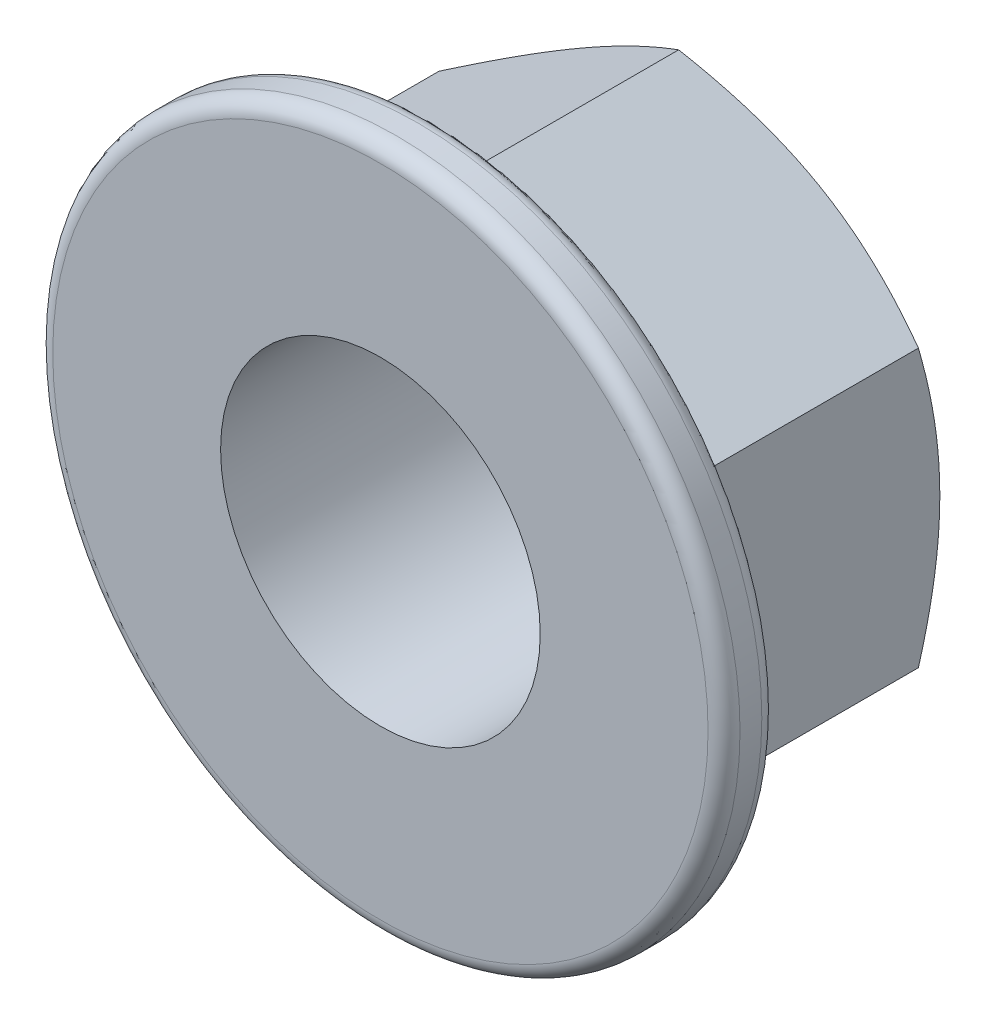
ISO-10303-21;
HEADER;
FILE_DESCRIPTION(('STEP AP214'),'2;1');
FILE_NAME('part.step','',(''),(''),'','','');
FILE_SCHEMA(('AUTOMOTIVE_DESIGN { 1 0 10303 214 1 1 1 1 }'));
ENDSEC;
DATA;
#1=APPLICATION_CONTEXT('core data for automotive mechanical design processes');
#2=APPLICATION_PROTOCOL_DEFINITION('international standard','automotive_design',2000,#1);
#3=PRODUCT_CONTEXT('',#1,'mechanical');
#4=PRODUCT('Part','Part','',(#3));
#5=PRODUCT_RELATED_PRODUCT_CATEGORY('part','',(#4));
#6=PRODUCT_DEFINITION_FORMATION('','',#4);
#7=PRODUCT_DEFINITION_CONTEXT('part definition',#1,'design');
#8=PRODUCT_DEFINITION('design','',#6,#7);
#9=PRODUCT_DEFINITION_SHAPE('','',#8);
#10=(LENGTH_UNIT() NAMED_UNIT(*) SI_UNIT(.MILLI.,.METRE.));
#11=(NAMED_UNIT(*) PLANE_ANGLE_UNIT() SI_UNIT($,.RADIAN.));
#12=(NAMED_UNIT(*) SI_UNIT($,.STERADIAN.) SOLID_ANGLE_UNIT());
#13=UNCERTAINTY_MEASURE_WITH_UNIT(LENGTH_MEASURE(1.E-05),#10,'distance_accuracy_value','');
#14=(GEOMETRIC_REPRESENTATION_CONTEXT(3) GLOBAL_UNCERTAINTY_ASSIGNED_CONTEXT((#13)) GLOBAL_UNIT_ASSIGNED_CONTEXT((#10,
#11,#12)) REPRESENTATION_CONTEXT('',''));
#15=CARTESIAN_POINT('',(0.,0.,0.));
#16=DIRECTION('',(0.,0.,1.));
#17=DIRECTION('',(1.,0.,0.));
#18=AXIS2_PLACEMENT_3D('',#15,#16,#17);
#19=CARTESIAN_POINT('',(15.0000000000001,8.6602540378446,-20.));
#20=DIRECTION('',(0.5,0.86602540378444,0.));
#21=DIRECTION('',(-0.86602540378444,0.5,0.));
#22=AXIS2_PLACEMENT_3D('',#19,#20,#21);
#23=PLANE('',#22);
#24=DIRECTION('',(0.,0.,1.));
#25=VECTOR('',#24,1.);
#26=CARTESIAN_POINT('',(-4.44089209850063E-13,17.3205080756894,-19.9999999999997));
#27=LINE('',#26,#25);
#28=CARTESIAN_POINT('',(4.44089209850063E-13,17.320508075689,-18.6602540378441));
#29=VERTEX_POINT('',#28);
#30=CARTESIAN_POINT('',(-4.44089209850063E-13,17.3205080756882,-4.94892909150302));
#31=VERTEX_POINT('',#30);
#32=EDGE_CURVE('E131',#29,#31,#27,.T.);
#33=ORIENTED_EDGE('',*,*,#32,.T.);
#34=CARTESIAN_POINT('',(-0.000200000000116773,17.3206235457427,-4.9488752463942));
#35=CARTESIAN_POINT('',(0.453422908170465,17.0587242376,-5.07099761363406));
#36=CARTESIAN_POINT('',(0.908719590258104,16.7958585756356,-5.18527715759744));
#37=CARTESIAN_POINT('',(1.82272954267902,16.2681546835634,-5.39542841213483));
#38=CARTESIAN_POINT('',(2.28144452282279,16.0033154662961,-5.49129016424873));
#39=CARTESIAN_POINT('',(3.20230148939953,15.4716584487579,-5.66182575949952));
#40=CARTESIAN_POINT('',(3.66444628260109,15.2048390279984,-5.73647967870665));
#41=CARTESIAN_POINT('',(4.59110501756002,14.6698323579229,-5.86184395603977));
#42=CARTESIAN_POINT('',(5.05561849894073,14.4016453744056,-5.91255880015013));
#43=CARTESIAN_POINT('',(5.97659534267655,13.8699191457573,-5.98724348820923));
#44=CARTESIAN_POINT('',(6.43302592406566,13.6063988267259,-6.01174605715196));
#45=CARTESIAN_POINT('',(7.3464133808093,13.0790543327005,-6.03482444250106));
#46=CARTESIAN_POINT('',(7.80337028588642,12.8152301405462,-6.03339871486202));
#47=CARTESIAN_POINT('',(8.7162379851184,12.2881857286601,-6.00469234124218));
#48=CARTESIAN_POINT('',(9.17214935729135,12.0249651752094,-5.97743578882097));
#49=CARTESIAN_POINT('',(10.082306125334,11.4994859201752,-5.89824122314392));
#50=CARTESIAN_POINT('',(10.5365516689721,11.2372271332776,-5.84630545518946));
#51=CARTESIAN_POINT('',(11.3255602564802,10.7816928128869,-5.7360962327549));
#52=CARTESIAN_POINT('',(11.6608703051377,10.5881014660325,-5.68292736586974));
#53=CARTESIAN_POINT('',(12.329957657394,10.2018037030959,-5.56510857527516));
#54=CARTESIAN_POINT('',(12.6637350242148,10.0090972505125,-5.50045912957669));
#55=CARTESIAN_POINT('',(13.3323355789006,9.62308054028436,-5.36017224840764));
#56=CARTESIAN_POINT('',(13.6671453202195,9.42977804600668,-5.28445000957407));
#57=CARTESIAN_POINT('',(14.3349946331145,9.04419506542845,-5.12351239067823));
#58=CARTESIAN_POINT('',(14.6680344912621,8.85191441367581,-5.03829859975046));
#59=CARTESIAN_POINT('',(15.0001999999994,8.6601385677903,-4.94887524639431));
#60=B_SPLINE_CURVE_WITH_KNOTS('',3,(#34,#35,#36,#37,#38,#39,#40,#41,#42,#43,#44,#45,#46,#47,#48,
#49,#50,#51,#52,#53,#54,#55,#56,#57,#58,#59),.UNSPECIFIED.,.F.,.F.,(4,2,2,2,2,2,2,2,2,2,2,2,4),
(0.,1.61363115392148,3.22813235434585,4.84414533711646,6.45985537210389,8.04206551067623,
9.62436987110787,11.2051997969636,12.7858859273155,13.9581633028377,15.1303918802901,
16.3121204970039,17.493651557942),.UNSPECIFIED.);
#61=CARTESIAN_POINT('',(15.0000000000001,8.6602540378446,-4.94892909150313));
#62=VERTEX_POINT('',#61);
#63=EDGE_CURVE('E51',#31,#62,#60,.T.);
#64=ORIENTED_EDGE('',*,*,#63,.T.);
#65=DIRECTION('',(0.,0.,1.));
#66=VECTOR('',#65,1.);
#67=CARTESIAN_POINT('',(15.0000000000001,8.6602540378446,-20.));
#68=LINE('',#67,#66);
#69=CARTESIAN_POINT('',(15.0000000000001,8.66025403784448,-18.6602540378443));
#70=VERTEX_POINT('',#69);
#71=EDGE_CURVE('E146',#70,#62,#68,.T.);
#72=ORIENTED_EDGE('',*,*,#71,.F.);
#73=CARTESIAN_POINT('',(-0.000199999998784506,17.3206235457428,-18.6601873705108));
#74=CARTESIAN_POINT('',(0.329494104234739,17.1302745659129,-18.770078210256));
#75=CARTESIAN_POINT('',(0.660474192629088,16.9391831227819,-18.8749824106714));
#76=CARTESIAN_POINT('',(1.32508844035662,16.555467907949,-19.0734314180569));
#77=CARTESIAN_POINT('',(1.65872343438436,16.3628436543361,-19.1669724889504));
#78=CARTESIAN_POINT('',(2.3292922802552,15.9756905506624,-19.34143785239));
#79=CARTESIAN_POINT('',(2.66623200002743,15.7811583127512,-19.4223322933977));
#80=CARTESIAN_POINT('',(3.34245276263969,15.3907420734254,-19.5697673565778));
#81=CARTESIAN_POINT('',(3.68173367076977,15.1948581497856,-19.6363087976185));
#82=CARTESIAN_POINT('',(4.35394314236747,14.8067578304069,-19.7522076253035));
#83=CARTESIAN_POINT('',(4.68682180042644,14.6145702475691,-19.8019486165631));
#84=CARTESIAN_POINT('',(5.35410443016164,14.2293144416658,-19.8853532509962));
#85=CARTESIAN_POINT('',(5.68850843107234,14.0362462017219,-19.9190165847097));
#86=CARTESIAN_POINT('',(6.35787818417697,13.6497853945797,-19.9694159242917));
#87=CARTESIAN_POINT('',(6.69284279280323,13.4563934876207,-19.9861720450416));
#88=CARTESIAN_POINT('',(7.36308121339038,13.0694311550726,-20.002396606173));
#89=CARTESIAN_POINT('',(7.69835501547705,12.8758607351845,-20.0018655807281));
#90=CARTESIAN_POINT('',(8.32514688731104,12.5139822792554,-19.9847233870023));
#91=CARTESIAN_POINT('',(8.61670962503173,12.3456484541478,-19.970203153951));
#92=CARTESIAN_POINT('',(9.19916443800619,12.0093680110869,-19.9283628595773));
#93=CARTESIAN_POINT('',(9.49005646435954,11.8414214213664,-19.9010418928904));
#94=CARTESIAN_POINT('',(10.0710118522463,11.5060066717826,-19.834076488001));
#95=CARTESIAN_POINT('',(10.3610743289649,11.3385390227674,-19.7944218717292));
#96=CARTESIAN_POINT('',(10.9398394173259,11.0043888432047,-19.703484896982));
#97=CARTESIAN_POINT('',(11.2285419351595,10.8377063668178,-19.6522017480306));
#98=CARTESIAN_POINT('',(12.1049144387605,10.3317324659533,-19.4796131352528));
#99=CARTESIAN_POINT('',(12.6900465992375,9.99390625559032,-19.3410988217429));
#100=CARTESIAN_POINT('',(13.8515859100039,9.32329122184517,-19.0267280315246));
#101=CARTESIAN_POINT('',(14.4280079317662,8.99049381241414,-18.8509453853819));
#102=CARTESIAN_POINT('',(15.0002000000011,8.66013856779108,-18.660187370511));
#103=B_SPLINE_CURVE_WITH_KNOTS('',3,(#73,#74,#75,#76,#77,#78,#79,#80,#81,#82,#83,#84,#85,#86,
#87,#88,#89,#90,#91,#92,#93,#94,#95,#96,#97,#98,#99,#100,#101,#102),.UNSPECIFIED.,.F.,.F.,(4,2,
2,2,2,2,2,2,2,2,2,2,2,2,4),(0.,1.18875411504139,2.37789802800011,3.56980778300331,
4.76164951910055,5.92407379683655,7.08652044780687,8.2475824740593,9.40860862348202,
10.419306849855,11.4300765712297,12.441682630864,13.4533574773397,15.5211962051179,
17.5849760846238),.UNSPECIFIED.);
#104=CARTESIAN_POINT('',(7.49999999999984,12.9903810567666,-20.0000000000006));
#105=VERTEX_POINT('',#104);
#106=EDGE_CURVE('E159',#105,#70,#103,.T.);
#107=ORIENTED_EDGE('',*,*,#106,.F.);
#108=EDGE_CURVE('E135',#29,#105,#103,.T.);
#109=ORIENTED_EDGE('',*,*,#108,.F.);
#110=EDGE_LOOP('',(#33,#64,#72,#107,#109));
#111=FACE_BOUND('',#110,.T.);
#112=ADVANCED_FACE('F32',(#111),#23,.T.);
#113=CARTESIAN_POINT('',(14.9999999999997,-8.66025403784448,-20.0000000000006));
#114=DIRECTION('',(1.,0.,0.));
#115=DIRECTION('',(0.,0.,-1.));
#116=AXIS2_PLACEMENT_3D('',#113,#114,#115);
#117=PLANE('',#116);
#118=ORIENTED_EDGE('',*,*,#71,.T.);
#119=CARTESIAN_POINT('',(15.0000000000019,-23.1555120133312,-0.160442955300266));
#120=CARTESIAN_POINT('',(15.0000000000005,-22.8174171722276,-0.292759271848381));
#121=CARTESIAN_POINT('',(14.9999999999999,-22.4790337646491,-0.424337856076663));
#122=CARTESIAN_POINT('',(14.9999999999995,-21.8016293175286,-0.685851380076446));
#123=CARTESIAN_POINT('',(14.9999999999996,-21.4626082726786,-0.815786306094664));
#124=CARTESIAN_POINT('',(14.9999999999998,-20.4444276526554,-1.20289996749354));
#125=CARTESIAN_POINT('',(14.9999999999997,-19.7642290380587,-1.45735679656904));
#126=CARTESIAN_POINT('',(14.9999999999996,-18.3982988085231,-1.95811272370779));
#127=CARTESIAN_POINT('',(14.9999999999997,-17.7125563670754,-2.20438236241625));
#128=CARTESIAN_POINT('',(14.9999999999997,-16.3371264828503,-2.68561787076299));
#129=CARTESIAN_POINT('',(14.9999999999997,-15.6474391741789,-2.92058412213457));
#130=CARTESIAN_POINT('',(14.9999999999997,-14.2724090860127,-3.3732976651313));
#131=CARTESIAN_POINT('',(14.9999999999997,-13.5871275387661,-3.59123003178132));
#132=CARTESIAN_POINT('',(14.9999999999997,-12.2111613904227,-4.00957927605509));
#133=CARTESIAN_POINT('',(14.9999999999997,-11.520476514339,-4.20999525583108));
#134=CARTESIAN_POINT('',(14.9999999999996,-10.1336499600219,-4.58847333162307));
#135=CARTESIAN_POINT('',(14.9999999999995,-9.43751395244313,-4.76655603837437));
#136=CARTESIAN_POINT('',(14.9999999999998,-8.03869689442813,-5.09487734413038));
#137=CARTESIAN_POINT('',(15.0000000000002,-7.33601675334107,-5.24511975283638));
#138=CARTESIAN_POINT('',(15.0000000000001,-6.14757848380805,-5.46915588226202));
#139=CARTESIAN_POINT('',(14.9999999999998,-5.66354551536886,-5.55209615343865));
#140=CARTESIAN_POINT('',(14.9999999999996,-4.69269777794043,-5.69981969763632));
#141=CARTESIAN_POINT('',(14.9999999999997,-4.20588307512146,-5.76460340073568));
#142=CARTESIAN_POINT('',(14.9999999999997,-3.23022223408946,-5.87405519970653));
#143=CARTESIAN_POINT('',(14.9999999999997,-2.74137723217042,-5.91873332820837));
#144=CARTESIAN_POINT('',(14.9999999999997,-1.76218133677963,-5.98651657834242));
#145=CARTESIAN_POINT('',(14.9999999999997,-1.27183045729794,-6.00962189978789));
#146=CARTESIAN_POINT('',(14.9999999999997,-0.288465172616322,-6.0334698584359));
#147=CARTESIAN_POINT('',(14.9999999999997,0.204551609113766,-6.0341157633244));
#148=CARTESIAN_POINT('',(14.9999999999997,1.19009587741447,-6.01277548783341));
#149=CARTESIAN_POINT('',(14.9999999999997,1.68262335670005,-5.9907889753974));
#150=CARTESIAN_POINT('',(14.9999999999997,2.66628088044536,-5.92498708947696));
#151=CARTESIAN_POINT('',(14.9999999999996,3.15741069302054,-5.88116828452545));
#152=CARTESIAN_POINT('',(14.9999999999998,4.13738120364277,-5.77320200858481));
#153=CARTESIAN_POINT('',(15.0000000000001,4.62622198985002,-5.70905532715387));
#154=CARTESIAN_POINT('',(15.0000000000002,5.78892745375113,-5.53410631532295));
#155=CARTESIAN_POINT('',(14.9999999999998,6.46152025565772,-5.4148503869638));
#156=CARTESIAN_POINT('',(14.9999999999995,7.80083923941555,-5.14671589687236));
#157=CARTESIAN_POINT('',(14.9999999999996,8.46756392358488,-4.99782998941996));
#158=CARTESIAN_POINT('',(14.9999999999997,9.79579334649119,-4.67577271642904));
#159=CARTESIAN_POINT('',(14.9999999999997,10.4572919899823,-4.50257645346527));
#160=CARTESIAN_POINT('',(14.9999999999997,11.7748081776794,-4.13678309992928));
#161=CARTESIAN_POINT('',(14.9999999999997,12.4308260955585,-3.94418734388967));
#162=CARTESIAN_POINT('',(14.9999999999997,13.7419570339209,-3.54228888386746));
#163=CARTESIAN_POINT('',(14.9999999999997,14.3970415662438,-3.33289379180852));
#164=CARTESIAN_POINT('',(14.9999999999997,15.7030519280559,-2.90154583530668));
#165=CARTESIAN_POINT('',(14.9999999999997,16.3539777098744,-2.6795928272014));
#166=CARTESIAN_POINT('',(14.9999999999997,17.6519406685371,-2.22571535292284));
#167=CARTESIAN_POINT('',(14.9999999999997,18.2989797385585,-1.99379628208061));
#168=CARTESIAN_POINT('',(14.9999999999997,19.5900608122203,-1.52179462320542));
#169=CARTESIAN_POINT('',(14.9999999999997,20.2341028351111,-1.28171208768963));
#170=CARTESIAN_POINT('',(14.9999999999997,21.522585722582,-0.793770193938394));
#171=CARTESIAN_POINT('',(14.9999999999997,22.1670150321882,-0.545880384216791));
#172=CARTESIAN_POINT('',(14.9999999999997,23.4537129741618,-0.0445629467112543));
#173=CARTESIAN_POINT('',(14.9999999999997,24.0959816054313,0.208864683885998));
#174=CARTESIAN_POINT('',(14.9999999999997,25.3787717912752,0.720352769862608));
#175=CARTESIAN_POINT('',(14.9999999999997,26.0192930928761,0.978413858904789));
#176=CARTESIAN_POINT('',(14.9999999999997,27.2987710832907,1.49838698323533));
#177=CARTESIAN_POINT('',(14.9999999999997,27.9377277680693,1.76029902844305));
#178=CARTESIAN_POINT('',(14.9999999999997,29.2056507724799,2.28380209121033));
#179=CARTESIAN_POINT('',(14.9999999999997,29.8346351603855,2.545349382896));
#180=CARTESIAN_POINT('',(14.9999999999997,31.0914763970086,3.07113988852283));
#181=CARTESIAN_POINT('',(14.9999999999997,31.7193332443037,3.33538310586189));
#182=CARTESIAN_POINT('',(14.9999999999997,32.9739236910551,3.86611820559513));
#183=CARTESIAN_POINT('',(14.9999999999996,33.6006575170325,4.13260955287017));
#184=CARTESIAN_POINT('',(14.9999999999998,34.8532652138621,4.66759601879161));
#185=CARTESIAN_POINT('',(15.,35.4791390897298,4.93609112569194));
#186=CARTESIAN_POINT('',(15.0000000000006,36.1046454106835,5.2054370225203));
#187=B_SPLINE_CURVE_WITH_KNOTS('',3,(#119,#120,#121,#122,#123,#124,#125,#126,#127,#128,#129,
#130,#131,#132,#133,#134,#135,#136,#137,#138,#139,#140,#141,#142,#143,#144,#145,#146,#147,#148,
#149,#150,#151,#152,#153,#154,#155,#156,#157,#158,#159,#160,#161,#162,#163,#164,#165,#166,#167,
#168,#169,#170,#171,#172,#173,#174,#175,#176,#177,#178,#179,#180,#181,#182,#183,#184,#185,#186),
.UNSPECIFIED.,.F.,.F.,(4,2,2,2,2,2,2,2,2,2,2,2,2,2,2,2,2,2,2,2,2,2,2,2,2,2,2,2,2,2,2,2,2,4),(0.,
1.08919145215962,2.17839201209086,4.35704593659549,6.54283796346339,8.72855612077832,
10.8856751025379,13.0429045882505,15.198128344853,17.3530569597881,18.826027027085,
20.2989622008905,21.7711615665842,23.2433472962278,24.7218729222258,26.2004202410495,
27.6792000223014,29.1579223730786,31.2063207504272,33.2552275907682,35.3062483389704,
37.3571280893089,39.420182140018,41.4832597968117,43.5452342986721,45.6071955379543,
47.6785524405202,49.7499103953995,51.821553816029,53.8932025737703,55.9367841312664,
57.9803682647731,60.0234789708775,62.0665777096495),.UNSPECIFIED.);
#188=CARTESIAN_POINT('',(14.9999999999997,-8.66025403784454,-4.94892909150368));
#189=VERTEX_POINT('',#188);
#190=EDGE_CURVE('E178',#62,#189,#187,.F.);
#191=ORIENTED_EDGE('',*,*,#190,.T.);
#192=DIRECTION('',(0.,0.,1.));
#193=VECTOR('',#192,1.);
#194=CARTESIAN_POINT('',(14.9999999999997,-8.66025403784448,-20.0000000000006));
#195=LINE('',#194,#193);
#196=CARTESIAN_POINT('',(15.000000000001,-8.66025403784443,-18.6602540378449));
#197=VERTEX_POINT('',#196);
#198=EDGE_CURVE('E151',#197,#189,#195,.T.);
#199=ORIENTED_EDGE('',*,*,#198,.F.);
#200=CARTESIAN_POINT('',(15.0000000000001,-23.479849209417,-12.5739936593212));
#201=CARTESIAN_POINT('',(14.9999999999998,-23.1512152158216,-12.7338842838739));
#202=CARTESIAN_POINT('',(14.9999999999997,-22.8222012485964,-12.8929935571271));
#203=CARTESIAN_POINT('',(14.9999999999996,-22.1633341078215,-13.2094727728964));
#204=CARTESIAN_POINT('',(14.9999999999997,-21.8334809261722,-13.3668426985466));
#205=CARTESIAN_POINT('',(14.9999999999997,-20.8424585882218,-13.8361186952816));
#206=CARTESIAN_POINT('',(14.9999999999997,-20.1799207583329,-14.1451450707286));
#207=CARTESIAN_POINT('',(14.9999999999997,-18.8469816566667,-14.7553049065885));
#208=CARTESIAN_POINT('',(14.9999999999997,-18.176557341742,-15.056388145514));
#209=CARTESIAN_POINT('',(14.9999999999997,-16.8304492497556,-15.6465160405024));
#210=CARTESIAN_POINT('',(14.9999999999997,-16.1547657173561,-15.9355612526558));
#211=CARTESIAN_POINT('',(14.9999999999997,-14.7750341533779,-16.5075657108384));
#212=CARTESIAN_POINT('',(14.9999999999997,-14.0707770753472,-16.7900232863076));
#213=CARTESIAN_POINT('',(14.9999999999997,-12.6541012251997,-17.3340833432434));
#214=CARTESIAN_POINT('',(14.9999999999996,-11.9416815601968,-17.5956835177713));
#215=CARTESIAN_POINT('',(14.9999999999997,-10.5088311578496,-18.0913202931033));
#216=CARTESIAN_POINT('',(14.9999999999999,-9.78841917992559,-18.3254107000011));
#217=CARTESIAN_POINT('',(14.9999999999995,-8.33719975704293,-18.7586775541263));
#218=CARTESIAN_POINT('',(14.999999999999,-7.60639558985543,-18.9578647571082));
#219=CARTESIAN_POINT('',(14.9999999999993,-6.50413160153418,-19.2228630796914));
#220=CARTESIAN_POINT('',(14.9999999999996,-6.13666840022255,-19.3053935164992));
#221=CARTESIAN_POINT('',(14.9999999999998,-5.39919162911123,-19.458210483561));
#222=CARTESIAN_POINT('',(14.9999999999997,-5.02917810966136,-19.5284972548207));
#223=CARTESIAN_POINT('',(14.9999999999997,-4.28684333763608,-19.6555994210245));
#224=CARTESIAN_POINT('',(14.9999999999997,-3.91452214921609,-19.7124151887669));
#225=CARTESIAN_POINT('',(14.9999999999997,-3.1679468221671,-19.8114511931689));
#226=CARTESIAN_POINT('',(14.9999999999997,-2.79369276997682,-19.8536720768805));
#227=CARTESIAN_POINT('',(14.9999999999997,-2.04874938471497,-19.9221385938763));
#228=CARTESIAN_POINT('',(14.9999999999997,-1.6780790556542,-19.9485897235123));
#229=CARTESIAN_POINT('',(14.9999999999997,-0.935952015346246,-19.9857825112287));
#230=CARTESIAN_POINT('',(14.9999999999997,-0.564495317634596,-19.9965244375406));
#231=CARTESIAN_POINT('',(14.9999999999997,0.178549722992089,-20.0020423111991));
#232=CARTESIAN_POINT('',(14.9999999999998,0.5501380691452,-19.9968178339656));
#233=CARTESIAN_POINT('',(14.9999999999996,1.29275761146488,-19.9705323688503));
#234=CARTESIAN_POINT('',(14.9999999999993,1.66378878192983,-19.9494706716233));
#235=CARTESIAN_POINT('',(14.9999999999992,2.54852078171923,-19.8808173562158));
#236=CARTESIAN_POINT('',(14.9999999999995,3.06168091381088,-19.8261000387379));
#237=CARTESIAN_POINT('',(14.9999999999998,4.08431355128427,-19.689303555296));
#238=CARTESIAN_POINT('',(14.9999999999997,4.59378557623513,-19.6072208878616));
#239=CARTESIAN_POINT('',(14.9999999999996,6.11596979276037,-19.3242700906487));
#240=CARTESIAN_POINT('',(14.9999999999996,7.12196423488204,-19.0867419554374));
#241=CARTESIAN_POINT('',(14.9999999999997,8.62741486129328,-18.6730815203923));
#242=CARTESIAN_POINT('',(14.9999999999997,9.13461716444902,-18.5235084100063));
#243=CARTESIAN_POINT('',(14.9999999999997,10.1440942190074,-18.2084210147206));
#244=CARTESIAN_POINT('',(14.9999999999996,10.6463689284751,-18.0429065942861));
#245=CARTESIAN_POINT('',(14.9999999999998,11.6461636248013,-17.6986224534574));
#246=CARTESIAN_POINT('',(14.9999999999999,12.1436848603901,-17.5198563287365));
#247=CARTESIAN_POINT('',(14.9999999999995,12.8868440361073,-17.2433814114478));
#248=CARTESIAN_POINT('',(14.9999999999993,13.1340406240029,-17.1498365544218));
#249=CARTESIAN_POINT('',(15.0000000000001,13.6274558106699,-16.960201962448));
#250=CARTESIAN_POINT('',(15.0000000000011,13.8736744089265,-16.8641122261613));
#251=CARTESIAN_POINT('',(15.0000000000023,14.629690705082,-16.5649428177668));
#252=CARTESIAN_POINT('',(15.0000000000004,15.1379687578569,-16.3580166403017));
#253=CARTESIAN_POINT('',(14.999999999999,16.1510549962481,-15.9358189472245));
#254=CARTESIAN_POINT('',(14.9999999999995,16.6558630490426,-15.720547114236));
#255=CARTESIAN_POINT('',(14.9999999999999,17.6624997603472,-15.2829827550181));
#256=CARTESIAN_POINT('',(14.9999999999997,18.16432802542,-15.0606893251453));
#257=CARTESIAN_POINT('',(14.9999999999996,19.1653339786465,-14.6102035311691));
#258=CARTESIAN_POINT('',(14.9999999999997,19.6645116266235,-14.3820110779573));
#259=CARTESIAN_POINT('',(14.9999999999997,20.6608152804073,-13.9205026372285));
#260=CARTESIAN_POINT('',(14.9999999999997,21.1579400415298,-13.6871839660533));
#261=CARTESIAN_POINT('',(14.9999999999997,22.1501612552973,-13.2162694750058));
#262=CARTESIAN_POINT('',(14.9999999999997,22.645257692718,-12.9786736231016));
#263=CARTESIAN_POINT('',(14.9999999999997,24.1278133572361,-12.2604432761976));
#264=CARTESIAN_POINT('',(14.9999999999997,25.1126185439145,-11.7743288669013));
#265=CARTESIAN_POINT('',(14.9999999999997,27.0787593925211,-10.7901728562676));
#266=CARTESIAN_POINT('',(14.9999999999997,28.0600837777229,-10.2921088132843));
#267=CARTESIAN_POINT('',(14.9999999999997,30.0184244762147,-9.28755877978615));
#268=CARTESIAN_POINT('',(14.9999999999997,30.9954407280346,-8.78107266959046));
#269=CARTESIAN_POINT('',(14.9999999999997,32.9457257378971,-7.76169323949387));
#270=CARTESIAN_POINT('',(14.9999999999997,33.9189955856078,-7.24880200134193));
#271=CARTESIAN_POINT('',(14.9999999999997,35.862761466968,-6.21780614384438));
#272=CARTESIAN_POINT('',(14.9999999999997,36.8332575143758,-5.69970155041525));
#273=CARTESIAN_POINT('',(14.9999999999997,38.6468484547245,-4.7264421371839));
#274=CARTESIAN_POINT('',(14.9999999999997,39.490216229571,-4.2717953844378));
#275=CARTESIAN_POINT('',(14.9999999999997,41.1755012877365,-3.35982063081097));
#276=CARTESIAN_POINT('',(14.9999999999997,42.0174185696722,-2.90249262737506));
#277=CARTESIAN_POINT('',(14.9999999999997,44.5414797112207,-1.52704460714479));
#278=CARTESIAN_POINT('',(14.9999999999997,46.2217805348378,-0.605542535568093));
#279=CARTESIAN_POINT('',(14.9999999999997,49.5721572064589,1.24041527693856));
#280=CARTESIAN_POINT('',(14.9999999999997,51.24224729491,2.16484520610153));
#281=CARTESIAN_POINT('',(14.9999999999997,53.7452296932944,3.55515746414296));
#282=CARTESIAN_POINT('',(14.9999999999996,54.5791548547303,4.01918177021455));
#283=CARTESIAN_POINT('',(14.9999999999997,56.2463946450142,4.94832420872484));
#284=CARTESIAN_POINT('',(14.9999999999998,57.0797092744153,5.41344234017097));
#285=CARTESIAN_POINT('',(15.0000000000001,57.9127583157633,5.87903555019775));
#286=B_SPLINE_CURVE_WITH_KNOTS('',3,(#200,#201,#202,#203,#204,#205,#206,#207,#208,#209,#210,
#211,#212,#213,#214,#215,#216,#217,#218,#219,#220,#221,#222,#223,#224,#225,#226,#227,#228,#229,
#230,#231,#232,#233,#234,#235,#236,#237,#238,#239,#240,#241,#242,#243,#244,#245,#246,#247,#248,
#249,#250,#251,#252,#253,#254,#255,#256,#257,#258,#259,#260,#261,#262,#263,#264,#265,#266,#267,
#268,#269,#270,#271,#272,#273,#274,#275,#276,#277,#278,#279,#280,#281,#282,#283,#284,#285),
.UNSPECIFIED.,.F.,.F.,(4,2,2,2,2,2,2,2,2,2,2,2,2,2,2,2,2,2,2,2,2,2,2,2,2,2,2,2,2,2,2,2,2,2,2,2,
2,2,2,2,2,2,4),(0.,1.09639573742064,2.19280209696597,4.3859289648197,6.59062212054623,
8.79521331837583,11.0713271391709,13.3476923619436,15.619528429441,17.8906631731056,
19.0203436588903,20.1500019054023,21.2796288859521,22.4092057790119,23.5237217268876,
24.6382186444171,25.7527451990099,26.8673216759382,28.4146606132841,29.9621976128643,
33.0587283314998,34.6449798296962,36.2312448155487,37.8170809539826,38.6099816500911,
39.4028827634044,41.0491383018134,42.6954565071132,44.3419874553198,45.988543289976,
47.6359826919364,49.2834344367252,52.5780744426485,55.8794796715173,59.1809318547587,
62.481337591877,65.7817269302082,68.6560484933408,71.5303727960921,77.2795403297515,
83.006129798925,85.8691253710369,88.7321183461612),.UNSPECIFIED.);
#287=CARTESIAN_POINT('',(15.0000000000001,6.10622663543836E-13,-19.9999999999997));
#288=VERTEX_POINT('',#287);
#289=EDGE_CURVE('E225',#288,#197,#286,.F.);
#290=ORIENTED_EDGE('',*,*,#289,.F.);
#291=EDGE_CURVE('E230',#70,#288,#286,.F.);
#292=ORIENTED_EDGE('',*,*,#291,.F.);
#293=EDGE_LOOP('',(#118,#191,#199,#290,#292));
#294=FACE_BOUND('',#293,.T.);
#295=ADVANCED_FACE('F217',(#294),#117,.T.);
#296=CARTESIAN_POINT('',(14.9999999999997,-8.66025403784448,-20.0000000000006));
#297=DIRECTION('',(0.5,-0.86602540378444,0.));
#298=DIRECTION('',(0.86602540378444,0.5,0.));
#299=AXIS2_PLACEMENT_3D('',#296,#297,#298);
#300=PLANE('',#299);
#301=ORIENTED_EDGE('',*,*,#198,.T.);
#302=CARTESIAN_POINT('',(15.0001999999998,-8.66013856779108,-4.94887524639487));
#303=CARTESIAN_POINT('',(14.5465770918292,-8.92203787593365,-5.07099761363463));
#304=CARTESIAN_POINT('',(14.0912804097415,-9.18490353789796,-5.18527715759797));
#305=CARTESIAN_POINT('',(13.1772704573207,-9.71260742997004,-5.39542841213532));
#306=CARTESIAN_POINT('',(12.718555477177,-9.97744664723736,-5.49129016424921));
#307=CARTESIAN_POINT('',(11.7976985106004,-10.5091036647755,-5.66182575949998));
#308=CARTESIAN_POINT('',(11.3355537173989,-10.775923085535,-5.7364796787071));
#309=CARTESIAN_POINT('',(10.4088949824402,-11.3109297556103,-5.86184395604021));
#310=CARTESIAN_POINT('',(9.94438150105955,-11.5791167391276,-5.91255880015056));
#311=CARTESIAN_POINT('',(9.02340465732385,-12.1108429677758,-5.98724348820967));
#312=CARTESIAN_POINT('',(8.56697407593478,-12.3743632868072,-6.01174605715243));
#313=CARTESIAN_POINT('',(7.65358661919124,-12.9017077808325,-6.0348244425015));
#314=CARTESIAN_POINT('',(7.1966297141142,-13.1655319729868,-6.03339871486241));
#315=CARTESIAN_POINT('',(6.28376201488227,-13.6925763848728,-6.00469234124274));
#316=CARTESIAN_POINT('',(5.82785064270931,-13.9557969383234,-5.97743578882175));
#317=CARTESIAN_POINT('',(4.91769387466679,-14.4812761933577,-5.89824122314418));
#318=CARTESIAN_POINT('',(4.46344833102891,-14.7435349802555,-5.84630545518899));
#319=CARTESIAN_POINT('',(3.67443974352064,-15.1990693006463,-5.73609623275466));
#320=CARTESIAN_POINT('',(3.33912969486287,-15.3926606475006,-5.68292736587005));
#321=CARTESIAN_POINT('',(2.6700423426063,-15.7789584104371,-5.56510857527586));
#322=CARTESIAN_POINT('',(2.33626497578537,-15.9716648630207,-5.50045912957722));
#323=CARTESIAN_POINT('',(1.66766442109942,-16.357681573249,-5.36017224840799));
#324=CARTESIAN_POINT('',(1.3328546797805,-16.5509840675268,-5.28445000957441));
#325=CARTESIAN_POINT('',(0.665005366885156,-16.936567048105,-5.12351239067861));
#326=CARTESIAN_POINT('',(0.331965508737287,-17.1288476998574,-5.03829859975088));
#327=CARTESIAN_POINT('',(-0.000200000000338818,-17.3206235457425,-4.94887524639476));
#328=B_SPLINE_CURVE_WITH_KNOTS('',3,(#302,#303,#304,#305,#306,#307,#308,#309,#310,#311,#312,
#313,#314,#315,#316,#317,#318,#319,#320,#321,#322,#323,#324,#325,#326,#327),.UNSPECIFIED.,.F.,
.F.,(4,2,2,2,2,2,2,2,2,2,2,2,4),(0.,1.61363115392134,3.22813235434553,4.84414533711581,
6.45985537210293,8.04206551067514,9.62436987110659,11.2051997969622,12.7858859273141,
13.9581633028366,15.1303918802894,16.3121204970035,17.493651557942),.UNSPECIFIED.);
#329=CARTESIAN_POINT('',(0.,-17.320508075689,-4.9489290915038));
#330=VERTEX_POINT('',#329);
#331=EDGE_CURVE('E176',#189,#330,#328,.T.);
#332=ORIENTED_EDGE('',*,*,#331,.T.);
#333=DIRECTION('',(0.,0.,1.));
#334=VECTOR('',#333,1.);
#335=CARTESIAN_POINT('',(0.,-17.3205080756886,-20.0000000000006));
#336=LINE('',#335,#334);
#337=CARTESIAN_POINT('',(1.33226762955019E-12,-17.3205080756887,-18.6602540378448));
#338=VERTEX_POINT('',#337);
#339=EDGE_CURVE('E133',#338,#330,#336,.T.);
#340=ORIENTED_EDGE('',*,*,#339,.F.);
#341=CARTESIAN_POINT('',(15.0002000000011,-8.66013856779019,-18.6601873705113));
#342=CARTESIAN_POINT('',(14.6705058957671,-8.8504875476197,-18.770078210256));
#343=CARTESIAN_POINT('',(14.3395258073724,-9.04157899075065,-18.8749824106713));
#344=CARTESIAN_POINT('',(13.6749115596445,-9.42529420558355,-19.0734314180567));
#345=CARTESIAN_POINT('',(13.3412765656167,-9.61791845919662,-19.1669724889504));
#346=CARTESIAN_POINT('',(12.6707077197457,-10.0050715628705,-19.3414378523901));
#347=CARTESIAN_POINT('',(12.3337679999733,-10.1996038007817,-19.4223322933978));
#348=CARTESIAN_POINT('',(11.6575472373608,-10.5900200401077,-19.5697673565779));
#349=CARTESIAN_POINT('',(11.3182663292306,-10.7859039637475,-19.6363087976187));
#350=CARTESIAN_POINT('',(10.6460568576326,-11.1740042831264,-19.7522076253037));
#351=CARTESIAN_POINT('',(10.3131781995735,-11.3661918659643,-19.8019486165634));
#352=CARTESIAN_POINT('',(9.64589556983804,-11.7514476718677,-19.8853532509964));
#353=CARTESIAN_POINT('',(9.31149156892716,-11.9445159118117,-19.91901658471));
#354=CARTESIAN_POINT('',(8.64212181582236,-12.3309767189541,-19.969415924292));
#355=CARTESIAN_POINT('',(8.30715720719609,-12.5243686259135,-19.986172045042));
#356=CARTESIAN_POINT('',(7.63691878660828,-12.9113309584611,-20.002396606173));
#357=CARTESIAN_POINT('',(7.30164498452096,-13.1049013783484,-20.0018655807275));
#358=CARTESIAN_POINT('',(6.67485311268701,-13.4667798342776,-19.9847233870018));
#359=CARTESIAN_POINT('',(6.38329037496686,-13.635113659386,-19.9702031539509));
#360=CARTESIAN_POINT('',(5.80083556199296,-13.9713941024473,-19.9283628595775));
#361=CARTESIAN_POINT('',(5.50994353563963,-14.1393406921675,-19.9010418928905));
#362=CARTESIAN_POINT('',(4.92898814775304,-14.474755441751,-19.834076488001));
#363=CARTESIAN_POINT('',(4.63892567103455,-14.6422230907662,-19.7944218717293));
#364=CARTESIAN_POINT('',(4.06016058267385,-14.9763732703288,-19.7034848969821));
#365=CARTESIAN_POINT('',(3.77145806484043,-15.1430557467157,-19.6522017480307));
#366=CARTESIAN_POINT('',(2.89508556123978,-15.6490296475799,-19.4796131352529));
#367=CARTESIAN_POINT('',(2.30995340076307,-15.9868558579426,-19.3410988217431));
#368=CARTESIAN_POINT('',(1.14841408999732,-16.6574708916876,-19.026728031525));
#369=CARTESIAN_POINT('',(0.571992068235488,-16.9902683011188,-18.8509453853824));
#370=CARTESIAN_POINT('',(-0.000199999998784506,-17.3206235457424,-18.6601873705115));
#371=B_SPLINE_CURVE_WITH_KNOTS('',3,(#341,#342,#343,#344,#345,#346,#347,#348,#349,#350,#351,
#352,#353,#354,#355,#356,#357,#358,#359,#360,#361,#362,#363,#364,#365,#366,#367,#368,#369,#370),
.UNSPECIFIED.,.F.,.F.,(4,2,2,2,2,2,2,2,2,2,2,2,2,2,4),(0.,1.18875411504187,2.37789802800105,
3.56980778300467,4.76164951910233,5.92407379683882,7.0865204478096,8.24758247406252,
9.40860862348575,10.4193068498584,11.4300765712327,12.4416826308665,13.4533574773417,
15.5211962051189,17.5849760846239),.UNSPECIFIED.);
#372=CARTESIAN_POINT('',(7.49999999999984,-12.9903810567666,-19.9999999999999));
#373=VERTEX_POINT('',#372);
#374=EDGE_CURVE('E174',#373,#338,#371,.T.);
#375=ORIENTED_EDGE('',*,*,#374,.F.);
#376=EDGE_CURVE('E231',#197,#373,#371,.T.);
#377=ORIENTED_EDGE('',*,*,#376,.F.);
#378=EDGE_LOOP('',(#301,#332,#340,#375,#377));
#379=FACE_BOUND('',#378,.T.);
#380=ADVANCED_FACE('F172',(#379),#300,.T.);
#381=CARTESIAN_POINT('',(-14.9999999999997,-8.66025403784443,-19.9999999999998));
#382=DIRECTION('',(-0.5,-0.86602540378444,0.));
#383=DIRECTION('',(0.86602540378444,-0.5,0.));
#384=AXIS2_PLACEMENT_3D('',#381,#382,#383);
#385=PLANE('',#384);
#386=ORIENTED_EDGE('',*,*,#339,.T.);
#387=CARTESIAN_POINT('',(0.000200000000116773,-17.3206235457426,-4.94887524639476));
#388=CARTESIAN_POINT('',(-0.453422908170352,-17.0587242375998,-5.07099761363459));
#389=CARTESIAN_POINT('',(-0.90871959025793,-16.7958585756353,-5.18527715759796));
#390=CARTESIAN_POINT('',(-1.82272954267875,-16.2681546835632,-5.39542841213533));
#391=CARTESIAN_POINT('',(-2.28144452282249,-16.0033154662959,-5.49129016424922));
#392=CARTESIAN_POINT('',(-3.2023014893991,-15.4716584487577,-5.66182575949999));
#393=CARTESIAN_POINT('',(-3.66444628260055,-15.2048390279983,-5.73647967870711));
#394=CARTESIAN_POINT('',(-4.59110501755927,-14.6698323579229,-5.86184395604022));
#395=CARTESIAN_POINT('',(-5.05561849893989,-14.4016453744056,-5.91255880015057));
#396=CARTESIAN_POINT('',(-5.97659534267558,-13.8699191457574,-5.98724348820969));
#397=CARTESIAN_POINT('',(-6.43302592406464,-13.6063988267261,-6.01174605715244));
#398=CARTESIAN_POINT('',(-7.34641338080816,-13.0790543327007,-6.03482444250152));
#399=CARTESIAN_POINT('',(-7.80337028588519,-12.8152301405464,-6.03339871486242));
#400=CARTESIAN_POINT('',(-8.71623798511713,-12.2881857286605,-6.00469234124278));
#401=CARTESIAN_POINT('',(-9.17214935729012,-12.0249651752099,-5.97743578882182));
#402=CARTESIAN_POINT('',(-10.0823061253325,-11.4994859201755,-5.89824122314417));
#403=CARTESIAN_POINT('',(-10.5365516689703,-11.2372271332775,-5.84630545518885));
#404=CARTESIAN_POINT('',(-11.3255602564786,-10.7816928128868,-5.73609623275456));
#405=CARTESIAN_POINT('',(-11.6608703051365,-10.5881014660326,-5.68292736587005));
#406=CARTESIAN_POINT('',(-12.3299576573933,-10.2018037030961,-5.56510857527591));
#407=CARTESIAN_POINT('',(-12.6637350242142,-10.0090972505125,-5.50045912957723));
#408=CARTESIAN_POINT('',(-13.3323355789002,-9.62308054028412,-5.36017224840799));
#409=CARTESIAN_POINT('',(-13.6671453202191,-9.42977804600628,-5.28445000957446));
#410=CARTESIAN_POINT('',(-14.3349946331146,-9.04419506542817,-5.12351239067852));
#411=CARTESIAN_POINT('',(-14.6680344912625,-8.85191441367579,-5.03829859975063));
#412=CARTESIAN_POINT('',(-15.0002000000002,-8.66013856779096,-4.94887524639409));
#413=B_SPLINE_CURVE_WITH_KNOTS('',3,(#387,#388,#389,#390,#391,#392,#393,#394,#395,#396,#397,
#398,#399,#400,#401,#402,#403,#404,#405,#406,#407,#408,#409,#410,#411,#412),.UNSPECIFIED.,.F.,
.F.,(4,2,2,2,2,2,2,2,2,2,2,2,4),(0.,1.61363115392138,3.2281323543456,4.84414533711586,
6.45985537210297,8.04206551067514,9.62436987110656,11.2051997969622,12.785885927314,
13.9581633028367,15.1303918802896,16.3121204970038,17.4936515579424),.UNSPECIFIED.);
#414=CARTESIAN_POINT('',(-14.9999999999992,-8.66025403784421,-4.94892909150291));
#415=VERTEX_POINT('',#414);
#416=EDGE_CURVE('E118',#330,#415,#413,.T.);
#417=ORIENTED_EDGE('',*,*,#416,.T.);
#418=DIRECTION('',(0.,0.,1.));
#419=VECTOR('',#418,1.);
#420=CARTESIAN_POINT('',(-14.9999999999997,-8.66025403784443,-19.9999999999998));
#421=LINE('',#420,#419);
#422=CARTESIAN_POINT('',(-14.9999999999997,-8.66025403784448,-18.6602540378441));
#423=VERTEX_POINT('',#422);
#424=EDGE_CURVE('E116',#423,#415,#421,.T.);
#425=ORIENTED_EDGE('',*,*,#424,.F.);
#426=CARTESIAN_POINT('',(0.000200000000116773,-17.3206235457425,-18.6601873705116));
#427=CARTESIAN_POINT('',(-0.329494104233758,-17.1302745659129,-18.7700782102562));
#428=CARTESIAN_POINT('',(-0.660474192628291,-16.9391831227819,-18.8749824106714));
#429=CARTESIAN_POINT('',(-1.32508844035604,-16.555467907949,-19.0734314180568));
#430=CARTESIAN_POINT('',(-1.65872343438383,-16.362843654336,-19.1669724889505));
#431=CARTESIAN_POINT('',(-2.32929228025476,-15.9756905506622,-19.3414378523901));
#432=CARTESIAN_POINT('',(-2.66623200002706,-15.781158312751,-19.4223322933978));
#433=CARTESIAN_POINT('',(-3.34245276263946,-15.3907420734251,-19.5697673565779));
#434=CARTESIAN_POINT('',(-3.68173367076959,-15.1948581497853,-19.6363087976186));
#435=CARTESIAN_POINT('',(-4.35394314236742,-14.8067578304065,-19.7522076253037));
#436=CARTESIAN_POINT('',(-4.68682180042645,-14.6145702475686,-19.8019486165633));
#437=CARTESIAN_POINT('',(-5.35410443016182,-14.2293144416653,-19.8853532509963));
#438=CARTESIAN_POINT('',(-5.68850843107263,-14.0362462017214,-19.9190165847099));
#439=CARTESIAN_POINT('',(-6.35787818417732,-13.649785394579,-19.9694159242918));
#440=CARTESIAN_POINT('',(-6.69284279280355,-13.4563934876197,-19.9861720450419));
#441=CARTESIAN_POINT('',(-7.36308121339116,-13.0694311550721,-20.0023966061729));
#442=CARTESIAN_POINT('',(-7.69835501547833,-12.8758607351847,-20.0018655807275));
#443=CARTESIAN_POINT('',(-8.32514688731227,-12.5139822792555,-19.9847233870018));
#444=CARTESIAN_POINT('',(-8.61670962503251,-12.3456484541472,-19.9702031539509));
#445=CARTESIAN_POINT('',(-9.19916443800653,-12.009368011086,-19.9283628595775));
#446=CARTESIAN_POINT('',(-9.49005646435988,-11.8414214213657,-19.9010418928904));
#447=CARTESIAN_POINT('',(-10.0710118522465,-11.5060066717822,-19.834076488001));
#448=CARTESIAN_POINT('',(-10.361074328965,-11.3385390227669,-19.7944218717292));
#449=CARTESIAN_POINT('',(-10.9398394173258,-11.0043888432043,-19.703484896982));
#450=CARTESIAN_POINT('',(-11.2285419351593,-10.8377063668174,-19.6522017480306));
#451=CARTESIAN_POINT('',(-12.10491443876,-10.3317324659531,-19.4796131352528));
#452=CARTESIAN_POINT('',(-12.6900465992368,-9.9939062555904,-19.3410988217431));
#453=CARTESIAN_POINT('',(-13.8515859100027,-9.32329122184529,-19.0267280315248));
#454=CARTESIAN_POINT('',(-14.4280079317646,-8.9904938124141,-18.8509453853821));
#455=CARTESIAN_POINT('',(-15.0001999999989,-8.66013856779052,-18.6601873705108));
#456=B_SPLINE_CURVE_WITH_KNOTS('',3,(#426,#427,#428,#429,#430,#431,#432,#433,#434,#435,#436,
#437,#438,#439,#440,#441,#442,#443,#444,#445,#446,#447,#448,#449,#450,#451,#452,#453,#454,#455),
.UNSPECIFIED.,.F.,.F.,(4,2,2,2,2,2,2,2,2,2,2,2,2,2,4),(0.,1.18875411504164,2.3778980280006,
3.56980778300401,4.76164951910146,5.92407379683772,7.08652044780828,8.24758247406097,
9.40860862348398,10.4193068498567,11.4300765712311,12.4416826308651,13.4533574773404,
15.5211962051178,17.5849760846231),.UNSPECIFIED.);
#457=CARTESIAN_POINT('',(-7.50000000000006,-12.9903810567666,-20.0000000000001));
#458=VERTEX_POINT('',#457);
#459=EDGE_CURVE('E259',#458,#423,#456,.T.);
#460=ORIENTED_EDGE('',*,*,#459,.F.);
#461=EDGE_CURVE('E58',#338,#458,#456,.T.);
#462=ORIENTED_EDGE('',*,*,#461,.F.);
#463=EDGE_LOOP('',(#386,#417,#425,#460,#462));
#464=FACE_BOUND('',#463,.T.);
#465=ADVANCED_FACE('F168',(#464),#385,.T.);
#466=CARTESIAN_POINT('',(-14.9999999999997,-8.66025403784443,-19.9999999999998));
#467=DIRECTION('',(-1.,0.,0.));
#468=DIRECTION('',(0.,0.,1.));
#469=AXIS2_PLACEMENT_3D('',#466,#467,#468);
#470=PLANE('',#469);
#471=ORIENTED_EDGE('',*,*,#424,.T.);
#472=CARTESIAN_POINT('',(-14.999999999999,-23.1555120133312,-0.160442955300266));
#473=CARTESIAN_POINT('',(-14.9999999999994,-22.8174171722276,-0.292759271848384));
#474=CARTESIAN_POINT('',(-14.9999999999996,-22.479033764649,-0.424337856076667));
#475=CARTESIAN_POINT('',(-14.9999999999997,-21.8016293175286,-0.685851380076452));
#476=CARTESIAN_POINT('',(-14.9999999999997,-21.4626082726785,-0.81578630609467));
#477=CARTESIAN_POINT('',(-14.9999999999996,-20.4444276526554,-1.20289996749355));
#478=CARTESIAN_POINT('',(-14.9999999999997,-19.7642290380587,-1.45735679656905));
#479=CARTESIAN_POINT('',(-14.9999999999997,-18.3982988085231,-1.95811272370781));
#480=CARTESIAN_POINT('',(-14.9999999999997,-17.7125563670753,-2.20438236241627));
#481=CARTESIAN_POINT('',(-14.9999999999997,-16.3371264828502,-2.68561787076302));
#482=CARTESIAN_POINT('',(-14.9999999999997,-15.6474391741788,-2.9205841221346));
#483=CARTESIAN_POINT('',(-14.9999999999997,-14.2724090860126,-3.37329766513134));
#484=CARTESIAN_POINT('',(-14.9999999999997,-13.587127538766,-3.59123003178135));
#485=CARTESIAN_POINT('',(-14.9999999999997,-12.2111613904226,-4.00957927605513));
#486=CARTESIAN_POINT('',(-14.9999999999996,-11.5204765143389,-4.20999525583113));
#487=CARTESIAN_POINT('',(-14.9999999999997,-10.1336499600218,-4.5884733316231));
#488=CARTESIAN_POINT('',(-14.9999999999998,-9.43751395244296,-4.76655603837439));
#489=CARTESIAN_POINT('',(-14.9999999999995,-8.03869689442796,-5.09487734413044));
#490=CARTESIAN_POINT('',(-14.9999999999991,-7.33601675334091,-5.2451197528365));
#491=CARTESIAN_POINT('',(-14.9999999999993,-6.14757848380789,-5.46915588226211));
#492=CARTESIAN_POINT('',(-14.9999999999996,-5.66354551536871,-5.55209615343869));
#493=CARTESIAN_POINT('',(-14.9999999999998,-4.69269777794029,-5.69981969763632));
#494=CARTESIAN_POINT('',(-14.9999999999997,-4.20588307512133,-5.76460340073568));
#495=CARTESIAN_POINT('',(-14.9999999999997,-3.23022223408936,-5.87405519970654));
#496=CARTESIAN_POINT('',(-14.9999999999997,-2.74137723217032,-5.91873332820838));
#497=CARTESIAN_POINT('',(-14.9999999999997,-1.76218133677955,-5.98651657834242));
#498=CARTESIAN_POINT('',(-14.9999999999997,-1.27183045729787,-6.00962189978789));
#499=CARTESIAN_POINT('',(-14.9999999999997,-0.288465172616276,-6.03346985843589));
#500=CARTESIAN_POINT('',(-14.9999999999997,0.204551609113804,-6.03411576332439));
#501=CARTESIAN_POINT('',(-14.9999999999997,1.19009587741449,-6.01277548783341));
#502=CARTESIAN_POINT('',(-14.9999999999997,1.68262335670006,-5.99078897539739));
#503=CARTESIAN_POINT('',(-14.9999999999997,2.66628088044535,-5.92498708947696));
#504=CARTESIAN_POINT('',(-14.9999999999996,3.15741069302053,-5.88116828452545));
#505=CARTESIAN_POINT('',(-14.9999999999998,4.13738120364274,-5.77320200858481));
#506=CARTESIAN_POINT('',(-15.0000000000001,4.62622198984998,-5.70905532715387));
#507=CARTESIAN_POINT('',(-15.0000000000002,5.78892745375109,-5.53410631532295));
#508=CARTESIAN_POINT('',(-14.9999999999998,6.46152025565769,-5.4148503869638));
#509=CARTESIAN_POINT('',(-14.9999999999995,7.80083923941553,-5.14671589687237));
#510=CARTESIAN_POINT('',(-14.9999999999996,8.46756392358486,-4.99782998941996));
#511=CARTESIAN_POINT('',(-14.9999999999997,9.79579334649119,-4.67577271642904));
#512=CARTESIAN_POINT('',(-14.9999999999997,10.4572919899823,-4.50257645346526));
#513=CARTESIAN_POINT('',(-14.9999999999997,11.7748081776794,-4.13678309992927));
#514=CARTESIAN_POINT('',(-14.9999999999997,12.4308260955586,-3.94418734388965));
#515=CARTESIAN_POINT('',(-14.9999999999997,13.741957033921,-3.54228888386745));
#516=CARTESIAN_POINT('',(-14.9999999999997,14.3970415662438,-3.3328937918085));
#517=CARTESIAN_POINT('',(-14.9999999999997,15.703051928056,-2.90154583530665));
#518=CARTESIAN_POINT('',(-14.9999999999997,16.3539777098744,-2.67959282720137));
#519=CARTESIAN_POINT('',(-14.9999999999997,17.6519406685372,-2.22571535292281));
#520=CARTESIAN_POINT('',(-14.9999999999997,18.2989797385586,-1.99379628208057));
#521=CARTESIAN_POINT('',(-14.9999999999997,19.5900608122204,-1.52179462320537));
#522=CARTESIAN_POINT('',(-14.9999999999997,20.2341028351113,-1.28171208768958));
#523=CARTESIAN_POINT('',(-14.9999999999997,21.5225857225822,-0.793770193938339));
#524=CARTESIAN_POINT('',(-14.9999999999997,22.1670150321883,-0.545880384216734));
#525=CARTESIAN_POINT('',(-14.9999999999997,23.4537129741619,-0.0445629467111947));
#526=CARTESIAN_POINT('',(-14.9999999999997,24.0959816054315,0.20886468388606));
#527=CARTESIAN_POINT('',(-14.9999999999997,25.3787717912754,0.720352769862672));
#528=CARTESIAN_POINT('',(-14.9999999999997,26.0192930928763,0.978413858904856));
#529=CARTESIAN_POINT('',(-14.9999999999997,27.2987710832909,1.4983869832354));
#530=CARTESIAN_POINT('',(-14.9999999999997,27.9377277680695,1.76029902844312));
#531=CARTESIAN_POINT('',(-14.9999999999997,29.2056507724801,2.2838020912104));
#532=CARTESIAN_POINT('',(-14.9999999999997,29.8346351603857,2.54534938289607));
#533=CARTESIAN_POINT('',(-14.9999999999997,31.0914763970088,3.0711398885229));
#534=CARTESIAN_POINT('',(-14.9999999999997,31.7193332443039,3.33538310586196));
#535=CARTESIAN_POINT('',(-14.9999999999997,32.9739236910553,3.86611820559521));
#536=CARTESIAN_POINT('',(-14.9999999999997,33.6006575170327,4.13260955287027));
#537=CARTESIAN_POINT('',(-14.9999999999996,34.8532652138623,4.66759601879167));
#538=CARTESIAN_POINT('',(-14.9999999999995,35.47913908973,4.93609112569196));
#539=CARTESIAN_POINT('',(-14.9999999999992,36.1046454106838,5.20543702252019));
#540=B_SPLINE_CURVE_WITH_KNOTS('',3,(#472,#473,#474,#475,#476,#477,#478,#479,#480,#481,#482,
#483,#484,#485,#486,#487,#488,#489,#490,#491,#492,#493,#494,#495,#496,#497,#498,#499,#500,#501,
#502,#503,#504,#505,#506,#507,#508,#509,#510,#511,#512,#513,#514,#515,#516,#517,#518,#519,#520,
#521,#522,#523,#524,#525,#526,#527,#528,#529,#530,#531,#532,#533,#534,#535,#536,#537,#538,#539),
.UNSPECIFIED.,.F.,.F.,(4,2,2,2,2,2,2,2,2,2,2,2,2,2,2,2,2,2,2,2,2,2,2,2,2,2,2,2,2,2,2,2,2,4),(0.,
1.08919145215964,2.17839201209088,4.35704593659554,6.54283796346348,8.72855612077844,
10.885675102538,13.0429045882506,15.1981283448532,17.3530569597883,18.8260270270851,
20.2989622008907,21.7711615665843,23.2433472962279,24.7218729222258,26.2004202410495,
27.6792000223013,29.1579223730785,31.2063207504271,33.2552275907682,35.3062483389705,
37.3571280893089,39.4201821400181,41.4832597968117,43.5452342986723,45.6071955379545,
47.6785524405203,49.7499103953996,51.8215538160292,53.8932025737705,55.9367841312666,
57.9803682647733,60.0234789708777,62.0665777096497),.UNSPECIFIED.);
#541=CARTESIAN_POINT('',(-15.0000000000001,8.66025403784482,-4.94892909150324));
#542=VERTEX_POINT('',#541);
#543=EDGE_CURVE('E109',#415,#542,#540,.T.);
#544=ORIENTED_EDGE('',*,*,#543,.T.);
#545=DIRECTION('',(0.,0.,1.));
#546=VECTOR('',#545,1.);
#547=CARTESIAN_POINT('',(-15.0000000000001,8.6602540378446,-19.9999999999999));
#548=LINE('',#547,#546);
#549=CARTESIAN_POINT('',(-14.9999999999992,8.66025403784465,-18.6602540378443));
#550=VERTEX_POINT('',#549);
#551=EDGE_CURVE('E113',#550,#542,#548,.T.);
#552=ORIENTED_EDGE('',*,*,#551,.F.);
#553=CARTESIAN_POINT('',(-14.9999999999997,-23.4798492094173,-12.5739936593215));
#554=CARTESIAN_POINT('',(-14.9999999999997,-23.1512152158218,-12.733884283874));
#555=CARTESIAN_POINT('',(-14.9999999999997,-22.8222012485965,-12.892993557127));
#556=CARTESIAN_POINT('',(-14.9999999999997,-22.1633341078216,-13.2094727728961));
#557=CARTESIAN_POINT('',(-14.9999999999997,-21.8334809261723,-13.3668426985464));
#558=CARTESIAN_POINT('',(-14.9999999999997,-20.8424585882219,-13.8361186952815));
#559=CARTESIAN_POINT('',(-14.9999999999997,-20.179920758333,-14.1451450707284));
#560=CARTESIAN_POINT('',(-14.9999999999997,-18.8469816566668,-14.7553049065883));
#561=CARTESIAN_POINT('',(-14.9999999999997,-18.1765573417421,-15.0563881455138));
#562=CARTESIAN_POINT('',(-14.9999999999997,-16.8304492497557,-15.6465160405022));
#563=CARTESIAN_POINT('',(-14.9999999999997,-16.1547657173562,-15.9355612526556));
#564=CARTESIAN_POINT('',(-14.9999999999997,-14.7750341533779,-16.5075657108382));
#565=CARTESIAN_POINT('',(-14.9999999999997,-14.0707770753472,-16.7900232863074));
#566=CARTESIAN_POINT('',(-14.9999999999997,-12.6541012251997,-17.3340833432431));
#567=CARTESIAN_POINT('',(-14.9999999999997,-11.9416815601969,-17.5956835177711));
#568=CARTESIAN_POINT('',(-14.9999999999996,-10.5088311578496,-18.0913202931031));
#569=CARTESIAN_POINT('',(-14.9999999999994,-9.78841917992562,-18.3254107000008));
#570=CARTESIAN_POINT('',(-14.9999999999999,-8.33719975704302,-18.7586775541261));
#571=CARTESIAN_POINT('',(-15.0000000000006,-7.60639558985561,-18.9578647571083));
#572=CARTESIAN_POINT('',(-15.0000000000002,-6.50413160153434,-19.2228630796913));
#573=CARTESIAN_POINT('',(-14.9999999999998,-6.13666840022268,-19.305393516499));
#574=CARTESIAN_POINT('',(-14.9999999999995,-5.39919162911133,-19.4582104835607));
#575=CARTESIAN_POINT('',(-14.9999999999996,-5.02917810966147,-19.5284972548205));
#576=CARTESIAN_POINT('',(-14.9999999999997,-4.2868433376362,-19.6555994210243));
#577=CARTESIAN_POINT('',(-14.9999999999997,-3.91452214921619,-19.7124151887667));
#578=CARTESIAN_POINT('',(-14.9999999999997,-3.16794682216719,-19.8114511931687));
#579=CARTESIAN_POINT('',(-14.9999999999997,-2.79369276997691,-19.8536720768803));
#580=CARTESIAN_POINT('',(-14.9999999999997,-2.04874938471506,-19.9221385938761));
#581=CARTESIAN_POINT('',(-14.9999999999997,-1.67807905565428,-19.948589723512));
#582=CARTESIAN_POINT('',(-14.9999999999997,-0.935952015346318,-19.9857825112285));
#583=CARTESIAN_POINT('',(-14.9999999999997,-0.564495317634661,-19.9965244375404));
#584=CARTESIAN_POINT('',(-14.9999999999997,0.178549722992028,-20.0020423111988));
#585=CARTESIAN_POINT('',(-14.9999999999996,0.550138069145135,-19.9968178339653));
#586=CARTESIAN_POINT('',(-14.9999999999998,1.29275761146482,-19.9705323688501));
#587=CARTESIAN_POINT('',(-15.0000000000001,1.66378878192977,-19.9494706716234));
#588=CARTESIAN_POINT('',(-15.0000000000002,2.54852078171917,-19.8808173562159));
#589=CARTESIAN_POINT('',(-14.9999999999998,3.06168091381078,-19.8261000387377));
#590=CARTESIAN_POINT('',(-14.9999999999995,4.08431355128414,-19.6893035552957));
#591=CARTESIAN_POINT('',(-14.9999999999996,4.59378557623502,-19.6072208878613));
#592=CARTESIAN_POINT('',(-14.9999999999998,6.11596979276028,-19.3242700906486));
#593=CARTESIAN_POINT('',(-14.9999999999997,7.12196423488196,-19.0867419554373));
#594=CARTESIAN_POINT('',(-14.9999999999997,8.62741486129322,-18.673081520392));
#595=CARTESIAN_POINT('',(-14.9999999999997,9.13461716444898,-18.5235084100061));
#596=CARTESIAN_POINT('',(-14.9999999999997,10.1440942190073,-18.2084210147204));
#597=CARTESIAN_POINT('',(-14.9999999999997,10.6463689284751,-18.0429065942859));
#598=CARTESIAN_POINT('',(-14.9999999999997,11.6461636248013,-17.6986224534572));
#599=CARTESIAN_POINT('',(-14.9999999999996,12.1436848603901,-17.5198563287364));
#600=CARTESIAN_POINT('',(-14.9999999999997,12.8868440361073,-17.2433814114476));
#601=CARTESIAN_POINT('',(-14.9999999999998,13.1340406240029,-17.1498365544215));
#602=CARTESIAN_POINT('',(-14.9999999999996,13.6274558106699,-16.9602019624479));
#603=CARTESIAN_POINT('',(-14.9999999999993,13.8736744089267,-16.8641122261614));
#604=CARTESIAN_POINT('',(-14.999999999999,14.6296907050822,-16.5649428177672));
#605=CARTESIAN_POINT('',(-14.9999999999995,15.137968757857,-16.3580166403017));
#606=CARTESIAN_POINT('',(-14.9999999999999,16.151054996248,-15.9358189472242));
#607=CARTESIAN_POINT('',(-14.9999999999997,16.6558630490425,-15.7205471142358));
#608=CARTESIAN_POINT('',(-14.9999999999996,17.6624997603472,-15.282982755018));
#609=CARTESIAN_POINT('',(-14.9999999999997,18.16432802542,-15.0606893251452));
#610=CARTESIAN_POINT('',(-14.9999999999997,19.1653339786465,-14.610203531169));
#611=CARTESIAN_POINT('',(-14.9999999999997,19.6645116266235,-14.3820110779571));
#612=CARTESIAN_POINT('',(-14.9999999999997,20.6608152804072,-13.9205026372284));
#613=CARTESIAN_POINT('',(-14.9999999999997,21.1579400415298,-13.6871839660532));
#614=CARTESIAN_POINT('',(-14.9999999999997,22.1501612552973,-13.2162694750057));
#615=CARTESIAN_POINT('',(-14.9999999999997,22.645257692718,-12.9786736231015));
#616=CARTESIAN_POINT('',(-14.9999999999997,24.1278133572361,-12.2604432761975));
#617=CARTESIAN_POINT('',(-14.9999999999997,25.1126185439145,-11.7743288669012));
#618=CARTESIAN_POINT('',(-14.9999999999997,27.0787593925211,-10.7901728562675));
#619=CARTESIAN_POINT('',(-14.9999999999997,28.0600837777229,-10.2921088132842));
#620=CARTESIAN_POINT('',(-14.9999999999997,30.0184244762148,-9.28755877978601));
#621=CARTESIAN_POINT('',(-14.9999999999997,30.9954407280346,-8.78107266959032));
#622=CARTESIAN_POINT('',(-14.9999999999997,32.9457257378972,-7.76169323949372));
#623=CARTESIAN_POINT('',(-14.9999999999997,33.9189955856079,-7.24880200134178));
#624=CARTESIAN_POINT('',(-14.9999999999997,35.8627614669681,-6.21780614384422));
#625=CARTESIAN_POINT('',(-14.9999999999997,36.8332575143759,-5.69970155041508));
#626=CARTESIAN_POINT('',(-14.9999999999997,38.6468484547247,-4.72644213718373));
#627=CARTESIAN_POINT('',(-14.9999999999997,39.4902162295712,-4.27179538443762));
#628=CARTESIAN_POINT('',(-14.9999999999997,41.1755012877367,-3.35982063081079));
#629=CARTESIAN_POINT('',(-14.9999999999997,42.0174185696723,-2.90249262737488));
#630=CARTESIAN_POINT('',(-14.9999999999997,44.5414797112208,-1.52704460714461));
#631=CARTESIAN_POINT('',(-14.9999999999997,46.221780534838,-0.605542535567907));
#632=CARTESIAN_POINT('',(-14.9999999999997,49.5721572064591,1.24041527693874));
#633=CARTESIAN_POINT('',(-14.9999999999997,51.2422472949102,2.1648452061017));
#634=CARTESIAN_POINT('',(-14.9999999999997,53.7452296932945,3.55515746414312));
#635=CARTESIAN_POINT('',(-14.9999999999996,54.5791548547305,4.0191817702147));
#636=CARTESIAN_POINT('',(-14.9999999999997,56.2463946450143,4.94832420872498));
#637=CARTESIAN_POINT('',(-14.9999999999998,57.0797092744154,5.4134423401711));
#638=CARTESIAN_POINT('',(-15.0000000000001,57.9127583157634,5.87903555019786));
#639=B_SPLINE_CURVE_WITH_KNOTS('',3,(#553,#554,#555,#556,#557,#558,#559,#560,#561,#562,#563,
#564,#565,#566,#567,#568,#569,#570,#571,#572,#573,#574,#575,#576,#577,#578,#579,#580,#581,#582,
#583,#584,#585,#586,#587,#588,#589,#590,#591,#592,#593,#594,#595,#596,#597,#598,#599,#600,#601,
#602,#603,#604,#605,#606,#607,#608,#609,#610,#611,#612,#613,#614,#615,#616,#617,#618,#619,#620,
#621,#622,#623,#624,#625,#626,#627,#628,#629,#630,#631,#632,#633,#634,#635,#636,#637,#638),
.UNSPECIFIED.,.F.,.F.,(4,2,2,2,2,2,2,2,2,2,2,2,2,2,2,2,2,2,2,2,2,2,2,2,2,2,2,2,2,2,2,2,2,2,2,2,
2,2,2,2,2,2,4),(0.,1.09639573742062,2.19280209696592,4.38592896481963,6.59062212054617,
8.79521331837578,11.0713271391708,13.3476923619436,15.6195284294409,17.8906631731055,
19.0203436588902,20.1500019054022,21.279628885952,22.4092057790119,23.5237217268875,
24.6382186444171,25.7527451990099,26.8673216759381,28.414660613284,29.9621976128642,
33.0587283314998,34.6449798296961,36.2312448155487,37.8170809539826,38.6099816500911,
39.4028827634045,41.0491383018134,42.6954565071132,44.3419874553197,45.988543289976,
47.6359826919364,49.2834344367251,52.5780744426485,55.8794796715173,59.1809318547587,
62.4813375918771,65.7817269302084,68.656048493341,71.5303727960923,77.2795403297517,
83.0061297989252,85.869125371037,88.7321183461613),.UNSPECIFIED.);
#640=CARTESIAN_POINT('',(-14.9999999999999,0.,-19.9999999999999));
#641=VERTEX_POINT('',#640);
#642=EDGE_CURVE('E254',#641,#550,#639,.T.);
#643=ORIENTED_EDGE('',*,*,#642,.F.);
#644=EDGE_CURVE('E263',#423,#641,#639,.T.);
#645=ORIENTED_EDGE('',*,*,#644,.F.);
#646=EDGE_LOOP('',(#471,#544,#552,#643,#645));
#647=FACE_BOUND('',#646,.T.);
#648=ADVANCED_FACE('F110',(#647),#470,.T.);
#649=CARTESIAN_POINT('',(-15.0000000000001,8.6602540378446,-19.9999999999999));
#650=DIRECTION('',(-0.5,0.86602540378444,0.));
#651=DIRECTION('',(-0.86602540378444,-0.5,0.));
#652=AXIS2_PLACEMENT_3D('',#649,#650,#651);
#653=PLANE('',#652);
#654=ORIENTED_EDGE('',*,*,#551,.T.);
#655=CARTESIAN_POINT('',(-15.0001999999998,8.66013856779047,-4.94887524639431));
#656=CARTESIAN_POINT('',(-14.5465770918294,8.9220378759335,-5.07099761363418));
#657=CARTESIAN_POINT('',(-14.0912804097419,9.18490353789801,-5.18527715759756));
#658=CARTESIAN_POINT('',(-13.1772704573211,9.71260742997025,-5.39542841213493));
#659=CARTESIAN_POINT('',(-12.7185554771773,9.97744664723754,-5.49129016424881));
#660=CARTESIAN_POINT('',(-11.7976985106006,10.5091036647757,-5.66182575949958));
#661=CARTESIAN_POINT('',(-11.3355537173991,10.7759230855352,-5.73647967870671));
#662=CARTESIAN_POINT('',(-10.4088949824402,11.3109297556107,-5.86184395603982));
#663=CARTESIAN_POINT('',(-9.94438150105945,11.579116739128,-5.91255880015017));
#664=CARTESIAN_POINT('',(-9.02340465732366,12.1108429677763,-5.98724348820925));
#665=CARTESIAN_POINT('',(-8.56697407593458,12.3743632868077,-6.01174605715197));
#666=CARTESIAN_POINT('',(-7.65358661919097,12.901707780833,-6.03482444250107));
#667=CARTESIAN_POINT('',(-7.19662971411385,13.1655319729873,-6.03339871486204));
#668=CARTESIAN_POINT('',(-6.28376201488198,13.6925763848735,-6.00469234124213));
#669=CARTESIAN_POINT('',(-5.82785064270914,13.9557969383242,-5.97743578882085));
#670=CARTESIAN_POINT('',(-4.91769387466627,14.4812761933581,-5.89824122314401));
#671=CARTESIAN_POINT('',(-4.46344833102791,14.7435349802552,-5.84630545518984));
#672=CARTESIAN_POINT('',(-3.67443974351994,15.199069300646,-5.7360962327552));
#673=CARTESIAN_POINT('',(-3.33912969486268,15.3926606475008,-5.68292736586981));
#674=CARTESIAN_POINT('',(-2.67004234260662,15.7789584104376,-5.56510857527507));
#675=CARTESIAN_POINT('',(-2.33626497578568,15.9716648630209,-5.50045912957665));
#676=CARTESIAN_POINT('',(-1.66766442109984,16.357681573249,-5.36017224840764));
#677=CARTESIAN_POINT('',(-1.33285467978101,16.5509840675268,-5.28445000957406));
#678=CARTESIAN_POINT('',(-0.665005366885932,16.9365670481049,-5.1235123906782));
#679=CARTESIAN_POINT('',(-0.331965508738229,17.1288476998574,-5.03829859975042));
#680=CARTESIAN_POINT('',(0.000199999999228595,17.3206235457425,-4.94887524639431));
#681=B_SPLINE_CURVE_WITH_KNOTS('',3,(#655,#656,#657,#658,#659,#660,#661,#662,#663,#664,#665,
#666,#667,#668,#669,#670,#671,#672,#673,#674,#675,#676,#677,#678,#679,#680),.UNSPECIFIED.,.F.,
.F.,(4,2,2,2,2,2,2,2,2,2,2,2,4),(0.,1.61363115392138,3.22813235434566,4.84414533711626,
6.45985537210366,8.04206551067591,9.62436987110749,11.2051997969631,12.7858859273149,
13.9581633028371,15.1303918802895,16.3121204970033,17.4936515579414),.UNSPECIFIED.);
#682=EDGE_CURVE('E11',#542,#31,#681,.T.);
#683=ORIENTED_EDGE('',*,*,#682,.T.);
#684=ORIENTED_EDGE('',*,*,#32,.F.);
#685=CARTESIAN_POINT('',(-15.0001999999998,8.66013856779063,-18.6601873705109));
#686=CARTESIAN_POINT('',(-14.6705058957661,8.8504875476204,-18.7700782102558));
#687=CARTESIAN_POINT('',(-14.3395258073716,9.04157899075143,-18.8749824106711));
#688=CARTESIAN_POINT('',(-13.674911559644,9.42529420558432,-19.0734314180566));
#689=CARTESIAN_POINT('',(-13.3412765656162,9.61791845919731,-19.1669724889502));
#690=CARTESIAN_POINT('',(-12.6707077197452,10.0050715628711,-19.3414378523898));
#691=CARTESIAN_POINT('',(-12.333767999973,10.1996038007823,-19.4223322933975));
#692=CARTESIAN_POINT('',(-11.6575472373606,10.5900200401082,-19.5697673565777));
#693=CARTESIAN_POINT('',(-11.3182663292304,10.785903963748,-19.6363087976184));
#694=CARTESIAN_POINT('',(-10.6460568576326,11.1740042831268,-19.7522076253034));
#695=CARTESIAN_POINT('',(-10.3131781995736,11.3661918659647,-19.801948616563));
#696=CARTESIAN_POINT('',(-9.64589556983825,11.7514476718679,-19.8853532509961));
#697=CARTESIAN_POINT('',(-9.31149156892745,11.9445159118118,-19.9190165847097));
#698=CARTESIAN_POINT('',(-8.64212181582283,12.3309767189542,-19.9694159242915));
#699=CARTESIAN_POINT('',(-8.30715720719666,12.5243686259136,-19.9861720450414));
#700=CARTESIAN_POINT('',(-7.63691878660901,12.911330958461,-20.002396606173));
#701=CARTESIAN_POINT('',(-7.30164498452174,13.1049013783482,-20.0018655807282));
#702=CARTESIAN_POINT('',(-6.67485311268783,13.4667798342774,-19.9847233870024));
#703=CARTESIAN_POINT('',(-6.38329037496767,13.6351136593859,-19.9702031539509));
#704=CARTESIAN_POINT('',(-5.80083556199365,13.9713941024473,-19.9283628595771));
#705=CARTESIAN_POINT('',(-5.50994353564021,14.1393406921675,-19.9010418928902));
#706=CARTESIAN_POINT('',(-4.92898814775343,14.4747554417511,-19.8340764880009));
#707=CARTESIAN_POINT('',(-4.63892567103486,14.6422230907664,-19.7944218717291));
#708=CARTESIAN_POINT('',(-4.06016058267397,14.9763732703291,-19.7034848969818));
#709=CARTESIAN_POINT('',(-3.77145806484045,15.143055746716,-19.6522017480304));
#710=CARTESIAN_POINT('',(-2.89508556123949,15.6490296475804,-19.4796131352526));
#711=CARTESIAN_POINT('',(-2.3099534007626,15.9868558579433,-19.3410988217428));
#712=CARTESIAN_POINT('',(-1.14841408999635,16.6574708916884,-19.0267280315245));
#713=CARTESIAN_POINT('',(-0.571992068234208,16.9902683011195,-18.8509453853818));
#714=CARTESIAN_POINT('',(0.000200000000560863,17.3206235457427,-18.6601873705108));
#715=B_SPLINE_CURVE_WITH_KNOTS('',3,(#685,#686,#687,#688,#689,#690,#691,#692,#693,#694,#695,
#696,#697,#698,#699,#700,#701,#702,#703,#704,#705,#706,#707,#708,#709,#710,#711,#712,#713,#714),
.UNSPECIFIED.,.F.,.F.,(4,2,2,2,2,2,2,2,2,2,2,2,2,2,4),(0.,1.18875411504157,2.37789802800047,
3.56980778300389,4.76164951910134,5.92407379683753,7.08652044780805,8.24758247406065,
9.40860862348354,10.4193068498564,11.430076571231,12.4416826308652,13.4533574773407,
15.5211962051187,17.5849760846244),.UNSPECIFIED.);
#716=CARTESIAN_POINT('',(-7.50000000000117,12.9903810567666,-20.0000000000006));
#717=VERTEX_POINT('',#716);
#718=EDGE_CURVE('E246',#717,#29,#715,.T.);
#719=ORIENTED_EDGE('',*,*,#718,.F.);
#720=EDGE_CURVE('E130',#550,#717,#715,.T.);
#721=ORIENTED_EDGE('',*,*,#720,.F.);
#722=EDGE_LOOP('',(#654,#683,#684,#719,#721));
#723=FACE_BOUND('',#722,.T.);
#724=ADVANCED_FACE('F127',(#723),#653,.T.);
#725=CARTESIAN_POINT('',(-14.9999999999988,25.9807621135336,1.11022302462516E-13));
#726=DIRECTION('',(0.,0.,-1.));
#727=DIRECTION('',(-1.,0.,0.));
#728=AXIS2_PLACEMENT_3D('',#725,#726,#727);
#729=PLANE('',#728);
#730=CARTESIAN_POINT('',(2.22044604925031E-13,0.,1.11022302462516E-13));
#731=DIRECTION('',(0.,0.,1.));
#732=DIRECTION('',(1.,0.,0.));
#733=AXIS2_PLACEMENT_3D('',#730,#731,#732);
#734=CIRCLE('',#733,10.);
#735=CARTESIAN_POINT('',(10.0000000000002,0.,1.11577413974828E-13));
#736=VERTEX_POINT('',#735);
#737=EDGE_CURVE('E270',#736,#736,#734,.T.);
#738=ORIENTED_EDGE('',*,*,#737,.F.);
#739=EDGE_LOOP('',(#738));
#740=FACE_BOUND('',#739,.T.);
#741=CARTESIAN_POINT('',(2.22044604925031E-13,0.,1.11022302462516E-13));
#742=DIRECTION('',(0.,0.,1.));
#743=DIRECTION('',(1.,0.,0.));
#744=AXIS2_PLACEMENT_3D('',#741,#742,#743);
#745=CIRCLE('',#744,20.5);
#746=CARTESIAN_POINT('',(20.5000000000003,0.,1.12160281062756E-13));
#747=VERTEX_POINT('',#746);
#748=EDGE_CURVE('E390',#747,#747,#745,.T.);
#749=ORIENTED_EDGE('',*,*,#748,.T.);
#750=EDGE_LOOP('',(#749));
#751=FACE_BOUND('',#750,.T.);
#752=ADVANCED_FACE('F240',(#740,#751),#729,.F.);
#753=CARTESIAN_POINT('',(2.22044604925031E-13,0.,1.11022302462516E-13));
#754=DIRECTION('',(0.,0.,1.));
#755=DIRECTION('',(1.,0.,0.));
#756=AXIS2_PLACEMENT_3D('',#753,#754,#755);
#757=CONICAL_SURFACE('',#756,49.641016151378,1.0471975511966);
#758=ORIENTED_EDGE('',*,*,#642,.T.);
#759=ORIENTED_EDGE('',*,*,#720,.T.);
#760=CARTESIAN_POINT('',(0.,0.,-20.0000000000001));
#761=DIRECTION('',(0.,0.,-1.));
#762=DIRECTION('',(-1.,0.,0.));
#763=AXIS2_PLACEMENT_3D('',#760,#761,#762);
#764=CIRCLE('',#763,15.);
#765=EDGE_CURVE('E265',#641,#717,#764,.T.);
#766=ORIENTED_EDGE('',*,*,#765,.F.);
#767=EDGE_LOOP('',(#758,#759,#766));
#768=FACE_BOUND('',#767,.T.);
#769=ADVANCED_FACE('F236',(#768),#757,.T.);
#770=ORIENTED_EDGE('',*,*,#108,.T.);
#771=CARTESIAN_POINT('',(0.,0.,-20.0000000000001));
#772=DIRECTION('',(0.,0.,-1.));
#773=DIRECTION('',(-1.,0.,0.));
#774=AXIS2_PLACEMENT_3D('',#771,#772,#773);
#775=CIRCLE('',#774,15.);
#776=EDGE_CURVE('E139',#105,#717,#775,.F.);
#777=ORIENTED_EDGE('',*,*,#776,.T.);
#778=ORIENTED_EDGE('',*,*,#718,.T.);
#779=EDGE_LOOP('',(#770,#777,#778));
#780=FACE_BOUND('',#779,.T.);
#781=ADVANCED_FACE('F239',(#780),#757,.T.);
#782=ORIENTED_EDGE('',*,*,#106,.T.);
#783=ORIENTED_EDGE('',*,*,#291,.T.);
#784=EDGE_CURVE('E145',#288,#105,#775,.F.);
#785=ORIENTED_EDGE('',*,*,#784,.T.);
#786=EDGE_LOOP('',(#782,#783,#785));
#787=FACE_BOUND('',#786,.T.);
#788=ADVANCED_FACE('F285',(#787),#757,.T.);
#789=ORIENTED_EDGE('',*,*,#289,.T.);
#790=ORIENTED_EDGE('',*,*,#376,.T.);
#791=EDGE_CURVE('E143',#373,#288,#775,.F.);
#792=ORIENTED_EDGE('',*,*,#791,.T.);
#793=EDGE_LOOP('',(#789,#790,#792));
#794=FACE_BOUND('',#793,.T.);
#795=ADVANCED_FACE('F280',(#794),#757,.T.);
#796=ORIENTED_EDGE('',*,*,#374,.T.);
#797=ORIENTED_EDGE('',*,*,#461,.T.);
#798=EDGE_CURVE('E138',#458,#373,#775,.F.);
#799=ORIENTED_EDGE('',*,*,#798,.T.);
#800=EDGE_LOOP('',(#796,#797,#799));
#801=FACE_BOUND('',#800,.T.);
#802=ADVANCED_FACE('F283',(#801),#757,.T.);
#803=ORIENTED_EDGE('',*,*,#459,.T.);
#804=ORIENTED_EDGE('',*,*,#644,.T.);
#805=EDGE_CURVE('E44',#641,#458,#775,.F.);
#806=ORIENTED_EDGE('',*,*,#805,.T.);
#807=EDGE_LOOP('',(#803,#804,#806));
#808=FACE_BOUND('',#807,.T.);
#809=ADVANCED_FACE('F242',(#808),#757,.T.);
#810=CARTESIAN_POINT('',(-15.0000000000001,25.9807621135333,-20.0000000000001));
#811=DIRECTION('',(0.,0.,-1.));
#812=DIRECTION('',(-1.,0.,0.));
#813=AXIS2_PLACEMENT_3D('',#810,#811,#812);
#814=PLANE('',#813);
#815=CARTESIAN_POINT('',(0.,0.,-20.0000000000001));
#816=DIRECTION('',(0.,0.,1.));
#817=DIRECTION('',(1.,0.,0.));
#818=AXIS2_PLACEMENT_3D('',#815,#816,#817);
#819=CIRCLE('',#818,10.);
#820=CARTESIAN_POINT('',(10.,0.,-20.0000000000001));
#821=VERTEX_POINT('',#820);
#822=EDGE_CURVE('E267',#821,#821,#819,.T.);
#823=ORIENTED_EDGE('',*,*,#822,.T.);
#824=EDGE_LOOP('',(#823));
#825=FACE_BOUND('',#824,.T.);
#826=ORIENTED_EDGE('',*,*,#805,.F.);
#827=ORIENTED_EDGE('',*,*,#765,.T.);
#828=ORIENTED_EDGE('',*,*,#776,.F.);
#829=ORIENTED_EDGE('',*,*,#784,.F.);
#830=ORIENTED_EDGE('',*,*,#791,.F.);
#831=ORIENTED_EDGE('',*,*,#798,.F.);
#832=EDGE_LOOP('',(#826,#827,#828,#829,#830,#831));
#833=FACE_BOUND('',#832,.T.);
#834=ADVANCED_FACE('F221',(#825,#833),#814,.T.);
#835=CARTESIAN_POINT('',(0.,0.,-20.0000000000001));
#836=DIRECTION('',(0.,0.,1.));
#837=DIRECTION('',(1.,0.,0.));
#838=AXIS2_PLACEMENT_3D('',#835,#836,#837);
#839=CYLINDRICAL_SURFACE('',#838,10.);
#840=ORIENTED_EDGE('',*,*,#822,.F.);
#841=EDGE_LOOP('',(#840));
#842=FACE_BOUND('',#841,.T.);
#843=ORIENTED_EDGE('',*,*,#737,.T.);
#844=EDGE_LOOP('',(#843));
#845=FACE_BOUND('',#844,.T.);
#846=ADVANCED_FACE('F201',(#842,#845),#839,.F.);
#847=CARTESIAN_POINT('',(0.,-3.88578058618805E-13,-6.03099977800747));
#848=DIRECTION('',(0.,0.,1.));
#849=DIRECTION('',(1.,0.,0.));
#850=AXIS2_PLACEMENT_3D('',#847,#848,#849);
#851=CONICAL_SURFACE('',#850,15.,1.13446401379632);
#852=ORIENTED_EDGE('',*,*,#63,.F.);
#853=ORIENTED_EDGE('',*,*,#682,.F.);
#854=ORIENTED_EDGE('',*,*,#543,.F.);
#855=ORIENTED_EDGE('',*,*,#416,.F.);
#856=ORIENTED_EDGE('',*,*,#331,.F.);
#857=ORIENTED_EDGE('',*,*,#190,.F.);
#858=EDGE_LOOP('',(#852,#853,#854,#855,#856,#857));
#859=FACE_BOUND('',#858,.T.);
#860=CARTESIAN_POINT('',(2.22044604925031E-13,-1.11022302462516E-13,-3.26923752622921));
#861=DIRECTION('',(0.,0.,1.));
#862=DIRECTION('',(1.,0.,0.));
#863=AXIS2_PLACEMENT_3D('',#860,#861,#862);
#864=CIRCLE('',#863,20.9226182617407);
#865=CARTESIAN_POINT('',(20.922618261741,-1.09860863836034E-13,-3.26923752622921));
#866=VERTEX_POINT('',#865);
#867=EDGE_CURVE('E119',#866,#866,#864,.T.);
#868=ORIENTED_EDGE('',*,*,#867,.F.);
#869=EDGE_LOOP('',(#868));
#870=FACE_BOUND('',#869,.T.);
#871=ADVANCED_FACE('F121',(#859,#870),#851,.T.);
#872=CARTESIAN_POINT('',(0.,-1.66533453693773E-13,-2.36292973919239));
#873=DIRECTION('',(0.,0.,1.));
#874=DIRECTION('',(1.,0.,0.));
#875=AXIS2_PLACEMENT_3D('',#872,#873,#874);
#876=TOROIDAL_SURFACE('',#875,20.5,0.999999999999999);
#877=CARTESIAN_POINT('',(0.,-1.66533453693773E-13,-2.36292973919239));
#878=DIRECTION('',(0.,0.,1.));
#879=DIRECTION('',(1.,0.,0.));
#880=AXIS2_PLACEMENT_3D('',#877,#878,#879);
#881=CIRCLE('',#880,21.5);
#882=CARTESIAN_POINT('',(21.5,-1.65339963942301E-13,-2.36292973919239));
#883=VERTEX_POINT('',#882);
#884=EDGE_CURVE('E394',#883,#883,#881,.T.);
#885=ORIENTED_EDGE('',*,*,#884,.F.);
#886=EDGE_LOOP('',(#885));
#887=FACE_BOUND('',#886,.T.);
#888=ORIENTED_EDGE('',*,*,#867,.T.);
#889=EDGE_LOOP('',(#888));
#890=FACE_BOUND('',#889,.T.);
#891=ADVANCED_FACE('F200',(#887,#890),#876,.T.);
#892=CARTESIAN_POINT('',(2.22044604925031E-13,0.,1.11022302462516E-13));
#893=DIRECTION('',(0.,0.,1.));
#894=DIRECTION('',(1.,0.,0.));
#895=AXIS2_PLACEMENT_3D('',#892,#893,#894);
#896=CYLINDRICAL_SURFACE('',#895,21.5);
#897=CARTESIAN_POINT('',(0.,-1.66533453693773E-13,-0.999999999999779));
#898=DIRECTION('',(0.,0.,1.));
#899=DIRECTION('',(1.,0.,0.));
#900=AXIS2_PLACEMENT_3D('',#897,#898,#899);
#901=CIRCLE('',#900,21.5);
#902=CARTESIAN_POINT('',(21.5,-1.65339963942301E-13,-0.999999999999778));
#903=VERTEX_POINT('',#902);
#904=EDGE_CURVE('E393',#903,#903,#901,.T.);
#905=ORIENTED_EDGE('',*,*,#904,.F.);
#906=EDGE_LOOP('',(#905));
#907=FACE_BOUND('',#906,.T.);
#908=ORIENTED_EDGE('',*,*,#884,.T.);
#909=EDGE_LOOP('',(#908));
#910=FACE_BOUND('',#909,.T.);
#911=ADVANCED_FACE('F370',(#907,#910),#896,.T.);
#912=CARTESIAN_POINT('',(0.,-1.66533453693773E-13,-0.999999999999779));
#913=DIRECTION('',(0.,0.,1.));
#914=DIRECTION('',(1.,0.,0.));
#915=AXIS2_PLACEMENT_3D('',#912,#913,#914);
#916=TOROIDAL_SURFACE('',#915,20.5,1.);
#917=ORIENTED_EDGE('',*,*,#748,.F.);
#918=EDGE_LOOP('',(#917));
#919=FACE_BOUND('',#918,.T.);
#920=ORIENTED_EDGE('',*,*,#904,.T.);
#921=EDGE_LOOP('',(#920));
#922=FACE_BOUND('',#921,.T.);
#923=ADVANCED_FACE('F377',(#919,#922),#916,.T.);
#924=CLOSED_SHELL('',(#112,#295,#380,#465,#648,#724,#752,#769,#781,#788,#795,#802,#809,#834,
#846,#871,#891,#911,#923));
#925=MANIFOLD_SOLID_BREP('B2',#924);
#926=ADVANCED_BREP_SHAPE_REPRESENTATION('',(#18,#925),#14);
#927=SHAPE_DEFINITION_REPRESENTATION(#9,#926);
ENDSEC;
END-ISO-10303-21;
